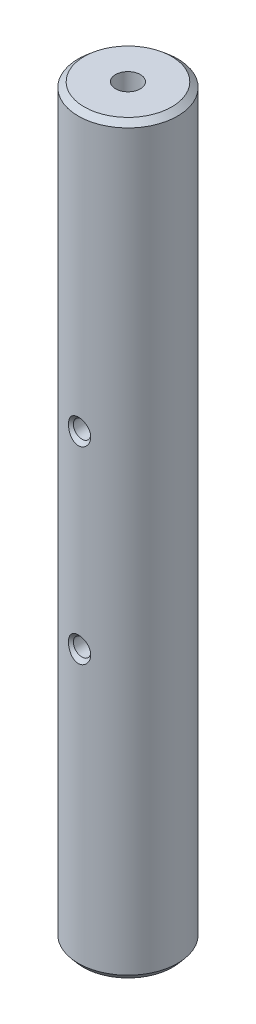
from build123d import *
from OCP.BRepFilletAPI import BRepFilletAPI_MakeChamfer

# Parameters (mm, degrees)
SKETCH1_R           = 10
BOSS_EXTRUDE1_DEPTH = 75
CHAMFER1_SIZE       = 1
CHAMFER1_SIZE2      = 1.191753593


with BuildPart() as part:
    # Sketch1 → Boss-Extrude1 (new, symmetric)
    with BuildSketch(Plane(origin=(0, 0, 0), x_dir=(1, 0, 0), z_dir=(0, 1, 0))):
        with Locations(Location((0, 0, 0), (0, 0, 270))):
            Circle(SKETCH1_R)
    extrude(amount=BOSS_EXTRUDE1_DEPTH, both=True)

    # Chamfer1: one chamfer whose edges measure the first distance from different faces: ONE call of the kernel's chamfer builder (chamfer() names one face for all edges)
    chamfer1_edges_1 = [part.edges().sort_by_distance(p)[0] for p in [
        (0, -75, -10),
    ]]
    chamfer1_side_1 = [part.faces().sort_by_distance(p)[0] for p in [
        (0, -75, 0),
    ]]
    chamfer1_edges_2 = [part.edges().sort_by_distance(p)[0] for p in [
        (0, 75, -10),
    ]]
    chamfer1_side_2 = [part.faces().sort_by_distance(p)[0] for p in [
        (0, 0, -10),
    ]]
    chamfer1 = BRepFilletAPI_MakeChamfer(part.part.solid().wrapped)
    for e in chamfer1_edges_1:
        chamfer1.Add(CHAMFER1_SIZE, CHAMFER1_SIZE2, e.wrapped, chamfer1_side_1[0].wrapped)  # the first distance lies on this face
    for e in chamfer1_edges_2:
        chamfer1.Add(CHAMFER1_SIZE, CHAMFER1_SIZE2, e.wrapped, chamfer1_side_2[0].wrapped)  # the first distance lies on this face
    add(Compound.cast(chamfer1.Shape()), mode=Mode.REPLACE)

    # Sketch4 → M6 Tapped Hole1 (revolve, cut)
    with BuildSketch(Plane(origin=(0, 75, 0), x_dir=(0, 0, 1), z_dir=(1, 0, 0))):
        Polygon((0, 0), (0, 16.502151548), (2.5, 15), (2.5, 0), align=None)
    m6_tapped_hole1 = revolve(axis=Axis((0, 81.35, 0), (0, -1, 0)), mode=Mode.SUBTRACT)

    # Sketch7 → 4.0 _4_ Diameter Hole1 (revolve, cut)
    with BuildSketch(Plane(origin=(0, 75, 0), x_dir=(0, 0, 1), z_dir=(1, 0, 0))):
        Polygon((0, 0), (0, 61.201721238), (2, 60), (2, 0), align=None)
    f_4_0_4_diameter_hole1 = revolve(axis=Axis((0, 81.35, 0), (0, -1, 0)), mode=Mode.SUBTRACT)

    # Sketch10 → 3.5 _3.5_ Diameter Hole2 (revolve, cut)
    with BuildSketch(Plane(origin=(0, 19, 10), x_dir=(0, -1, 0), z_dir=(1, 0, 0))):
        Polygon((0, 0), (0, 20), (2.5, 20), (1.75, 19.25), (1.75, 0.75), (2.5, 0), align=None)
    f_3_5_3_5_diameter_hole2 = revolve(axis=Axis((0, 19, 16.35), (0, 0, -1)), mode=Mode.SUBTRACT)

    # Mirror1: M6 Tapped Hole1, 4.0 _4_ Diameter Hole1, 3.5 _3.5_ Diameter Hole2 across plane
    add(m6_tapped_hole1.mirror(Plane.ZX), mode=Mode.SUBTRACT)
    add(f_4_0_4_diameter_hole1.mirror(Plane.ZX), mode=Mode.SUBTRACT)
    add(f_3_5_3_5_diameter_hole2.mirror(Plane.ZX), mode=Mode.SUBTRACT)


solid = part.part
